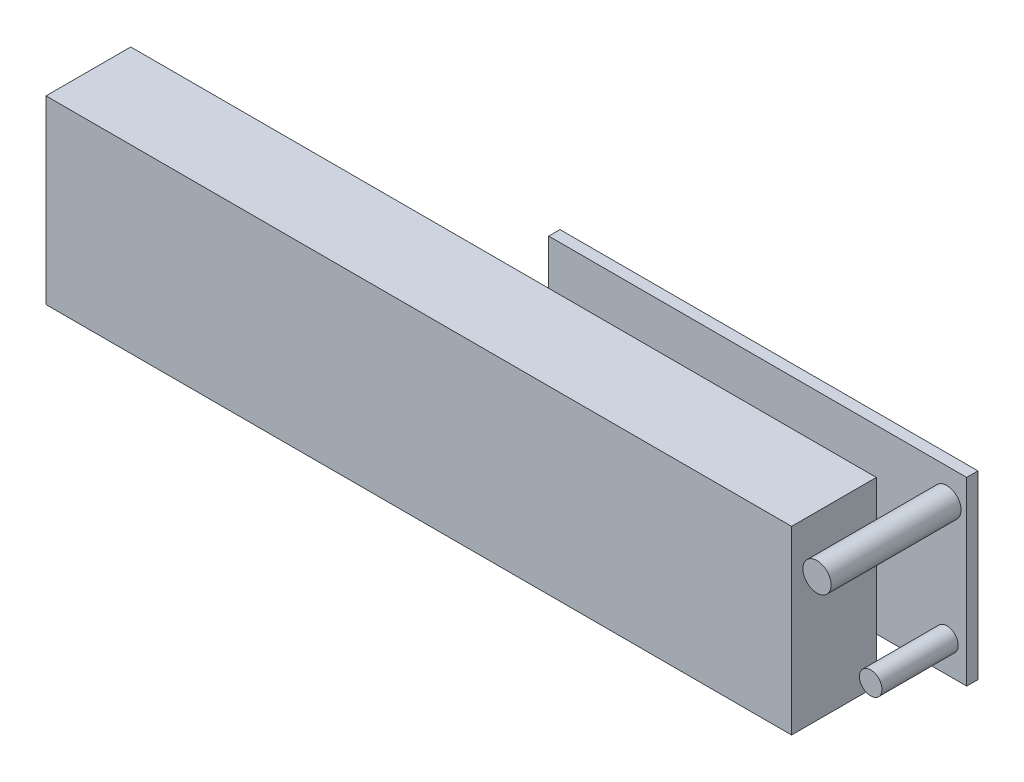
ISO-10303-21;
HEADER;
FILE_DESCRIPTION(('STEP AP214'),'2;1');
FILE_NAME('part.step','',(''),(''),'','','');
FILE_SCHEMA(('AUTOMOTIVE_DESIGN { 1 0 10303 214 1 1 1 1 }'));
ENDSEC;
DATA;
#1=APPLICATION_CONTEXT('core data for automotive mechanical design processes');
#2=APPLICATION_PROTOCOL_DEFINITION('international standard','automotive_design',2000,#1);
#3=PRODUCT_CONTEXT('',#1,'mechanical');
#4=PRODUCT('Part','Part','',(#3));
#5=PRODUCT_RELATED_PRODUCT_CATEGORY('part','',(#4));
#6=PRODUCT_DEFINITION_FORMATION('','',#4);
#7=PRODUCT_DEFINITION_CONTEXT('part definition',#1,'design');
#8=PRODUCT_DEFINITION('design','',#6,#7);
#9=PRODUCT_DEFINITION_SHAPE('','',#8);
#10=(LENGTH_UNIT() NAMED_UNIT(*) SI_UNIT(.MILLI.,.METRE.));
#11=(NAMED_UNIT(*) PLANE_ANGLE_UNIT() SI_UNIT($,.RADIAN.));
#12=(NAMED_UNIT(*) SI_UNIT($,.STERADIAN.) SOLID_ANGLE_UNIT());
#13=UNCERTAINTY_MEASURE_WITH_UNIT(LENGTH_MEASURE(1.E-05),#10,'distance_accuracy_value','');
#14=(GEOMETRIC_REPRESENTATION_CONTEXT(3) GLOBAL_UNCERTAINTY_ASSIGNED_CONTEXT((#13)) GLOBAL_UNIT_ASSIGNED_CONTEXT((#10,
#11,#12)) REPRESENTATION_CONTEXT('',''));
#15=CARTESIAN_POINT('',(0.,0.,0.));
#16=DIRECTION('',(0.,0.,1.));
#17=DIRECTION('',(1.,0.,0.));
#18=AXIS2_PLACEMENT_3D('',#15,#16,#17);
#19=CARTESIAN_POINT('',(0.,16.,-10.));
#20=DIRECTION('',(1.,0.,0.));
#21=DIRECTION('',(0.,1.,0.));
#22=AXIS2_PLACEMENT_3D('',#19,#20,#21);
#23=PLANE('',#22);
#24=DIRECTION('',(0.,1.,0.));
#25=VECTOR('',#24,1.);
#26=CARTESIAN_POINT('',(0.,16.,-8.));
#27=LINE('',#26,#25);
#28=CARTESIAN_POINT('',(0.,-16.,-8.));
#29=VERTEX_POINT('',#28);
#30=CARTESIAN_POINT('',(0.,16.,-8.));
#31=VERTEX_POINT('',#30);
#32=EDGE_CURVE('E115',#29,#31,#27,.T.);
#33=ORIENTED_EDGE('',*,*,#32,.T.);
#34=DIRECTION('',(0.,0.,1.));
#35=VECTOR('',#34,1.);
#36=CARTESIAN_POINT('',(0.,16.,-10.));
#37=LINE('',#36,#35);
#38=CARTESIAN_POINT('',(0.,16.,-10.));
#39=VERTEX_POINT('',#38);
#40=EDGE_CURVE('E12',#39,#31,#37,.T.);
#41=ORIENTED_EDGE('',*,*,#40,.F.);
#42=DIRECTION('',(0.,1.,0.));
#43=VECTOR('',#42,1.);
#44=CARTESIAN_POINT('',(0.,16.,-10.));
#45=LINE('',#44,#43);
#46=CARTESIAN_POINT('',(0.,-16.,-10.));
#47=VERTEX_POINT('',#46);
#48=EDGE_CURVE('E103',#47,#39,#45,.T.);
#49=ORIENTED_EDGE('',*,*,#48,.F.);
#50=DIRECTION('',(0.,0.,1.));
#51=VECTOR('',#50,1.);
#52=CARTESIAN_POINT('',(0.,-16.,-10.));
#53=LINE('',#52,#51);
#54=EDGE_CURVE('E111',#47,#29,#53,.T.);
#55=ORIENTED_EDGE('',*,*,#54,.T.);
#56=EDGE_LOOP('',(#33,#41,#49,#55));
#57=FACE_BOUND('',#56,.T.);
#58=ADVANCED_FACE('F52',(#57),#23,.F.);
#59=CARTESIAN_POINT('',(0.,16.,-10.));
#60=DIRECTION('',(0.,-1.,0.));
#61=DIRECTION('',(1.,0.,0.));
#62=AXIS2_PLACEMENT_3D('',#59,#60,#61);
#63=PLANE('',#62);
#64=DIRECTION('',(1.,0.,0.));
#65=VECTOR('',#64,1.);
#66=CARTESIAN_POINT('',(0.,16.,-8.));
#67=LINE('',#66,#65);
#68=CARTESIAN_POINT('',(74.,16.,-8.));
#69=VERTEX_POINT('',#68);
#70=EDGE_CURVE('E107',#31,#69,#67,.T.);
#71=ORIENTED_EDGE('',*,*,#70,.T.);
#72=DIRECTION('',(0.,0.,1.));
#73=VECTOR('',#72,1.);
#74=CARTESIAN_POINT('',(74.,16.,-10.));
#75=LINE('',#74,#73);
#76=CARTESIAN_POINT('',(74.,16.,-10.));
#77=VERTEX_POINT('',#76);
#78=EDGE_CURVE('E60',#77,#69,#75,.T.);
#79=ORIENTED_EDGE('',*,*,#78,.F.);
#80=DIRECTION('',(1.,0.,0.));
#81=VECTOR('',#80,1.);
#82=CARTESIAN_POINT('',(0.,16.,-10.));
#83=LINE('',#82,#81);
#84=EDGE_CURVE('E98',#39,#77,#83,.T.);
#85=ORIENTED_EDGE('',*,*,#84,.F.);
#86=ORIENTED_EDGE('',*,*,#40,.T.);
#87=EDGE_LOOP('',(#71,#79,#85,#86));
#88=FACE_BOUND('',#87,.T.);
#89=ADVANCED_FACE('F106',(#88),#63,.F.);
#90=CARTESIAN_POINT('',(74.,16.,-10.));
#91=DIRECTION('',(-1.,0.,0.));
#92=DIRECTION('',(0.,0.,1.));
#93=AXIS2_PLACEMENT_3D('',#90,#91,#92);
#94=PLANE('',#93);
#95=DIRECTION('',(0.,-1.,0.));
#96=VECTOR('',#95,1.);
#97=CARTESIAN_POINT('',(74.,16.,-8.));
#98=LINE('',#97,#96);
#99=CARTESIAN_POINT('',(74.,-16.,-8.));
#100=VERTEX_POINT('',#99);
#101=EDGE_CURVE('E85',#69,#100,#98,.T.);
#102=ORIENTED_EDGE('',*,*,#101,.T.);
#103=DIRECTION('',(0.,0.,1.));
#104=VECTOR('',#103,1.);
#105=CARTESIAN_POINT('',(74.,-16.,-10.));
#106=LINE('',#105,#104);
#107=CARTESIAN_POINT('',(74.,-16.,-10.));
#108=VERTEX_POINT('',#107);
#109=EDGE_CURVE('E108',#108,#100,#106,.T.);
#110=ORIENTED_EDGE('',*,*,#109,.F.);
#111=DIRECTION('',(0.,-1.,0.));
#112=VECTOR('',#111,1.);
#113=CARTESIAN_POINT('',(74.,16.,-10.));
#114=LINE('',#113,#112);
#115=EDGE_CURVE('E101',#77,#108,#114,.T.);
#116=ORIENTED_EDGE('',*,*,#115,.F.);
#117=ORIENTED_EDGE('',*,*,#78,.T.);
#118=EDGE_LOOP('',(#102,#110,#116,#117));
#119=FACE_BOUND('',#118,.T.);
#120=ADVANCED_FACE('F109',(#119),#94,.F.);
#121=CARTESIAN_POINT('',(0.,-16.,-10.));
#122=DIRECTION('',(0.,1.,0.));
#123=DIRECTION('',(-1.,0.,0.));
#124=AXIS2_PLACEMENT_3D('',#121,#122,#123);
#125=PLANE('',#124);
#126=DIRECTION('',(-1.,0.,0.));
#127=VECTOR('',#126,1.);
#128=CARTESIAN_POINT('',(0.,-16.,-8.));
#129=LINE('',#128,#127);
#130=EDGE_CURVE('E91',#100,#29,#129,.T.);
#131=ORIENTED_EDGE('',*,*,#130,.T.);
#132=ORIENTED_EDGE('',*,*,#54,.F.);
#133=DIRECTION('',(-1.,0.,0.));
#134=VECTOR('',#133,1.);
#135=CARTESIAN_POINT('',(0.,-16.,-10.));
#136=LINE('',#135,#134);
#137=EDGE_CURVE('E68',#108,#47,#136,.T.);
#138=ORIENTED_EDGE('',*,*,#137,.F.);
#139=ORIENTED_EDGE('',*,*,#109,.T.);
#140=EDGE_LOOP('',(#131,#132,#138,#139));
#141=FACE_BOUND('',#140,.T.);
#142=ADVANCED_FACE('F123',(#141),#125,.F.);
#143=CARTESIAN_POINT('',(0.,0.,-10.));
#144=DIRECTION('',(0.,0.,1.));
#145=DIRECTION('',(1.,0.,0.));
#146=AXIS2_PLACEMENT_3D('',#143,#144,#145);
#147=PLANE('',#146);
#148=ORIENTED_EDGE('',*,*,#48,.T.);
#149=ORIENTED_EDGE('',*,*,#84,.T.);
#150=ORIENTED_EDGE('',*,*,#115,.T.);
#151=ORIENTED_EDGE('',*,*,#137,.T.);
#152=EDGE_LOOP('',(#148,#149,#150,#151));
#153=FACE_BOUND('',#152,.T.);
#154=ADVANCED_FACE('F99',(#153),#147,.F.);
#155=CARTESIAN_POINT('',(0.,0.,-8.));
#156=DIRECTION('',(0.,0.,1.));
#157=DIRECTION('',(1.,0.,0.));
#158=AXIS2_PLACEMENT_3D('',#155,#156,#157);
#159=PLANE('',#158);
#160=CARTESIAN_POINT('',(70.5,-10.5,-8.));
#161=DIRECTION('',(0.,0.,1.));
#162=DIRECTION('',(1.,0.,0.));
#163=AXIS2_PLACEMENT_3D('',#160,#161,#162);
#164=CIRCLE('',#163,2.);
#165=CARTESIAN_POINT('',(72.5,-10.5,-8.));
#166=VERTEX_POINT('',#165);
#167=EDGE_CURVE('E137',#166,#166,#164,.T.);
#168=ORIENTED_EDGE('',*,*,#167,.F.);
#169=EDGE_LOOP('',(#168));
#170=FACE_BOUND('',#169,.T.);
#171=CARTESIAN_POINT('',(70.5,10.5,-8.));
#172=DIRECTION('',(0.,0.,1.));
#173=DIRECTION('',(1.,0.,0.));
#174=AXIS2_PLACEMENT_3D('',#171,#172,#173);
#175=CIRCLE('',#174,2.5);
#176=CARTESIAN_POINT('',(73.,10.5,-8.));
#177=VERTEX_POINT('',#176);
#178=EDGE_CURVE('E131',#177,#177,#175,.T.);
#179=ORIENTED_EDGE('',*,*,#178,.F.);
#180=EDGE_LOOP('',(#179));
#181=FACE_BOUND('',#180,.T.);
#182=ORIENTED_EDGE('',*,*,#32,.F.);
#183=ORIENTED_EDGE('',*,*,#130,.F.);
#184=ORIENTED_EDGE('',*,*,#101,.F.);
#185=ORIENTED_EDGE('',*,*,#70,.F.);
#186=EDGE_LOOP('',(#182,#183,#184,#185));
#187=FACE_BOUND('',#186,.T.);
#188=ADVANCED_FACE('F126',(#170,#181,#187),#159,.T.);
#189=CARTESIAN_POINT('',(70.5,10.5,22.0710678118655));
#190=DIRECTION('',(0.,0.,-1.));
#191=DIRECTION('',(-1.,0.,0.));
#192=AXIS2_PLACEMENT_3D('',#189,#190,#191);
#193=CYLINDRICAL_SURFACE('',#192,2.5);
#194=ORIENTED_EDGE('',*,*,#178,.T.);
#195=EDGE_LOOP('',(#194));
#196=FACE_BOUND('',#195,.T.);
#197=CARTESIAN_POINT('',(70.5,10.5,15.));
#198=DIRECTION('',(0.,0.,1.));
#199=DIRECTION('',(1.,0.,0.));
#200=AXIS2_PLACEMENT_3D('',#197,#198,#199);
#201=CIRCLE('',#200,2.5);
#202=CARTESIAN_POINT('',(73.,10.5,15.));
#203=VERTEX_POINT('',#202);
#204=EDGE_CURVE('E118',#203,#203,#201,.T.);
#205=ORIENTED_EDGE('',*,*,#204,.F.);
#206=EDGE_LOOP('',(#205));
#207=FACE_BOUND('',#206,.T.);
#208=ADVANCED_FACE('F146',(#196,#207),#193,.T.);
#209=CARTESIAN_POINT('',(0.,0.,15.));
#210=DIRECTION('',(0.,0.,1.));
#211=DIRECTION('',(1.,0.,0.));
#212=AXIS2_PLACEMENT_3D('',#209,#210,#211);
#213=PLANE('',#212);
#214=ORIENTED_EDGE('',*,*,#204,.T.);
#215=EDGE_LOOP('',(#214));
#216=FACE_BOUND('',#215,.T.);
#217=ADVANCED_FACE('F152',(#216),#213,.T.);
#218=CARTESIAN_POINT('',(70.5,-10.5,20.6568542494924));
#219=DIRECTION('',(0.,0.,-1.));
#220=DIRECTION('',(-1.,0.,0.));
#221=AXIS2_PLACEMENT_3D('',#218,#219,#220);
#222=CYLINDRICAL_SURFACE('',#221,2.);
#223=ORIENTED_EDGE('',*,*,#167,.T.);
#224=EDGE_LOOP('',(#223));
#225=FACE_BOUND('',#224,.T.);
#226=CARTESIAN_POINT('',(70.5,-10.5,5.5));
#227=DIRECTION('',(0.,0.,1.));
#228=DIRECTION('',(1.,0.,0.));
#229=AXIS2_PLACEMENT_3D('',#226,#227,#228);
#230=CIRCLE('',#229,2.);
#231=CARTESIAN_POINT('',(72.5,-10.5,5.5));
#232=VERTEX_POINT('',#231);
#233=EDGE_CURVE('E134',#232,#232,#230,.T.);
#234=ORIENTED_EDGE('',*,*,#233,.F.);
#235=EDGE_LOOP('',(#234));
#236=FACE_BOUND('',#235,.T.);
#237=ADVANCED_FACE('F141',(#225,#236),#222,.T.);
#238=CARTESIAN_POINT('',(0.,0.,5.5));
#239=DIRECTION('',(0.,0.,1.));
#240=DIRECTION('',(1.,0.,0.));
#241=AXIS2_PLACEMENT_3D('',#238,#239,#240);
#242=PLANE('',#241);
#243=ORIENTED_EDGE('',*,*,#233,.T.);
#244=EDGE_LOOP('',(#243));
#245=FACE_BOUND('',#244,.T.);
#246=ADVANCED_FACE('F161',(#245),#242,.T.);
#247=CLOSED_SHELL('',(#58,#89,#120,#142,#154,#188,#208,#217,#237,#246));
#248=MANIFOLD_SOLID_BREP('B2',#247);
#249=CARTESIAN_POINT('',(66.,16.,15.));
#250=DIRECTION('',(-1.,0.,0.));
#251=DIRECTION('',(0.,0.,1.));
#252=AXIS2_PLACEMENT_3D('',#249,#250,#251);
#253=PLANE('',#252);
#254=DIRECTION('',(0.,1.,0.));
#255=VECTOR('',#254,1.);
#256=CARTESIAN_POINT('',(66.,16.,0.));
#257=LINE('',#256,#255);
#258=CARTESIAN_POINT('',(66.,-16.,0.));
#259=VERTEX_POINT('',#258);
#260=CARTESIAN_POINT('',(66.,16.,0.));
#261=VERTEX_POINT('',#260);
#262=EDGE_CURVE('E303',#259,#261,#257,.T.);
#263=ORIENTED_EDGE('',*,*,#262,.T.);
#264=DIRECTION('',(0.,0.,-1.));
#265=VECTOR('',#264,1.);
#266=CARTESIAN_POINT('',(66.,16.,15.));
#267=LINE('',#266,#265);
#268=CARTESIAN_POINT('',(66.,16.,15.));
#269=VERTEX_POINT('',#268);
#270=EDGE_CURVE('E50',#269,#261,#267,.T.);
#271=ORIENTED_EDGE('',*,*,#270,.F.);
#272=DIRECTION('',(0.,1.,0.));
#273=VECTOR('',#272,1.);
#274=CARTESIAN_POINT('',(66.,16.,15.));
#275=LINE('',#274,#273);
#276=CARTESIAN_POINT('',(66.,-16.,15.));
#277=VERTEX_POINT('',#276);
#278=EDGE_CURVE('E291',#277,#269,#275,.T.);
#279=ORIENTED_EDGE('',*,*,#278,.F.);
#280=DIRECTION('',(0.,0.,-1.));
#281=VECTOR('',#280,1.);
#282=CARTESIAN_POINT('',(66.,-16.,15.));
#283=LINE('',#282,#281);
#284=EDGE_CURVE('E299',#277,#259,#283,.T.);
#285=ORIENTED_EDGE('',*,*,#284,.T.);
#286=EDGE_LOOP('',(#263,#271,#279,#285));
#287=FACE_BOUND('',#286,.T.);
#288=ADVANCED_FACE('F240',(#287),#253,.F.);
#289=CARTESIAN_POINT('',(-66.,16.,15.));
#290=DIRECTION('',(0.,-1.,0.));
#291=DIRECTION('',(0.,0.,-1.));
#292=AXIS2_PLACEMENT_3D('',#289,#290,#291);
#293=PLANE('',#292);
#294=DIRECTION('',(-1.,0.,0.));
#295=VECTOR('',#294,1.);
#296=CARTESIAN_POINT('',(-66.,16.,0.));
#297=LINE('',#296,#295);
#298=CARTESIAN_POINT('',(-66.,16.,0.));
#299=VERTEX_POINT('',#298);
#300=EDGE_CURVE('E295',#261,#299,#297,.T.);
#301=ORIENTED_EDGE('',*,*,#300,.T.);
#302=DIRECTION('',(0.,0.,-1.));
#303=VECTOR('',#302,1.);
#304=CARTESIAN_POINT('',(-66.,16.,15.));
#305=LINE('',#304,#303);
#306=CARTESIAN_POINT('',(-66.,16.,15.));
#307=VERTEX_POINT('',#306);
#308=EDGE_CURVE('E248',#307,#299,#305,.T.);
#309=ORIENTED_EDGE('',*,*,#308,.F.);
#310=DIRECTION('',(-1.,0.,0.));
#311=VECTOR('',#310,1.);
#312=CARTESIAN_POINT('',(-66.,16.,15.));
#313=LINE('',#312,#311);
#314=EDGE_CURVE('E286',#269,#307,#313,.T.);
#315=ORIENTED_EDGE('',*,*,#314,.F.);
#316=ORIENTED_EDGE('',*,*,#270,.T.);
#317=EDGE_LOOP('',(#301,#309,#315,#316));
#318=FACE_BOUND('',#317,.T.);
#319=ADVANCED_FACE('F294',(#318),#293,.F.);
#320=CARTESIAN_POINT('',(-66.,16.,15.));
#321=DIRECTION('',(1.,0.,0.));
#322=DIRECTION('',(0.,0.,-1.));
#323=AXIS2_PLACEMENT_3D('',#320,#321,#322);
#324=PLANE('',#323);
#325=DIRECTION('',(0.,-1.,0.));
#326=VECTOR('',#325,1.);
#327=CARTESIAN_POINT('',(-66.,16.,0.));
#328=LINE('',#327,#326);
#329=CARTESIAN_POINT('',(-66.,-16.,0.));
#330=VERTEX_POINT('',#329);
#331=EDGE_CURVE('E273',#299,#330,#328,.T.);
#332=ORIENTED_EDGE('',*,*,#331,.T.);
#333=DIRECTION('',(0.,0.,-1.));
#334=VECTOR('',#333,1.);
#335=CARTESIAN_POINT('',(-66.,-16.,15.));
#336=LINE('',#335,#334);
#337=CARTESIAN_POINT('',(-66.,-16.,15.));
#338=VERTEX_POINT('',#337);
#339=EDGE_CURVE('E296',#338,#330,#336,.T.);
#340=ORIENTED_EDGE('',*,*,#339,.F.);
#341=DIRECTION('',(0.,-1.,0.));
#342=VECTOR('',#341,1.);
#343=CARTESIAN_POINT('',(-66.,16.,15.));
#344=LINE('',#343,#342);
#345=EDGE_CURVE('E289',#307,#338,#344,.T.);
#346=ORIENTED_EDGE('',*,*,#345,.F.);
#347=ORIENTED_EDGE('',*,*,#308,.T.);
#348=EDGE_LOOP('',(#332,#340,#346,#347));
#349=FACE_BOUND('',#348,.T.);
#350=ADVANCED_FACE('F297',(#349),#324,.F.);
#351=CARTESIAN_POINT('',(-66.,-16.,15.));
#352=DIRECTION('',(0.,1.,0.));
#353=DIRECTION('',(0.,0.,1.));
#354=AXIS2_PLACEMENT_3D('',#351,#352,#353);
#355=PLANE('',#354);
#356=DIRECTION('',(1.,0.,0.));
#357=VECTOR('',#356,1.);
#358=CARTESIAN_POINT('',(-66.,-16.,0.));
#359=LINE('',#358,#357);
#360=EDGE_CURVE('E279',#330,#259,#359,.T.);
#361=ORIENTED_EDGE('',*,*,#360,.T.);
#362=ORIENTED_EDGE('',*,*,#284,.F.);
#363=DIRECTION('',(1.,0.,0.));
#364=VECTOR('',#363,1.);
#365=CARTESIAN_POINT('',(-66.,-16.,15.));
#366=LINE('',#365,#364);
#367=EDGE_CURVE('E256',#338,#277,#366,.T.);
#368=ORIENTED_EDGE('',*,*,#367,.F.);
#369=ORIENTED_EDGE('',*,*,#339,.T.);
#370=EDGE_LOOP('',(#361,#362,#368,#369));
#371=FACE_BOUND('',#370,.T.);
#372=ADVANCED_FACE('F311',(#371),#355,.F.);
#373=CARTESIAN_POINT('',(0.,0.,15.));
#374=DIRECTION('',(0.,0.,1.));
#375=DIRECTION('',(1.,0.,0.));
#376=AXIS2_PLACEMENT_3D('',#373,#374,#375);
#377=PLANE('',#376);
#378=ORIENTED_EDGE('',*,*,#278,.T.);
#379=ORIENTED_EDGE('',*,*,#314,.T.);
#380=ORIENTED_EDGE('',*,*,#345,.T.);
#381=ORIENTED_EDGE('',*,*,#367,.T.);
#382=EDGE_LOOP('',(#378,#379,#380,#381));
#383=FACE_BOUND('',#382,.T.);
#384=ADVANCED_FACE('F287',(#383),#377,.T.);
#385=CARTESIAN_POINT('',(0.,0.,0.));
#386=DIRECTION('',(0.,0.,1.));
#387=DIRECTION('',(1.,0.,0.));
#388=AXIS2_PLACEMENT_3D('',#385,#386,#387);
#389=PLANE('',#388);
#390=ORIENTED_EDGE('',*,*,#262,.F.);
#391=ORIENTED_EDGE('',*,*,#360,.F.);
#392=ORIENTED_EDGE('',*,*,#331,.F.);
#393=ORIENTED_EDGE('',*,*,#300,.F.);
#394=EDGE_LOOP('',(#390,#391,#392,#393));
#395=FACE_BOUND('',#394,.T.);
#396=ADVANCED_FACE('F314',(#395),#389,.F.);
#397=CLOSED_SHELL('',(#288,#319,#350,#372,#384,#396));
#398=MANIFOLD_SOLID_BREP('B6',#397);
#399=ADVANCED_BREP_SHAPE_REPRESENTATION('',(#18,#248,#398),#14);
#400=SHAPE_DEFINITION_REPRESENTATION(#9,#399);
ENDSEC;
END-ISO-10303-21;
